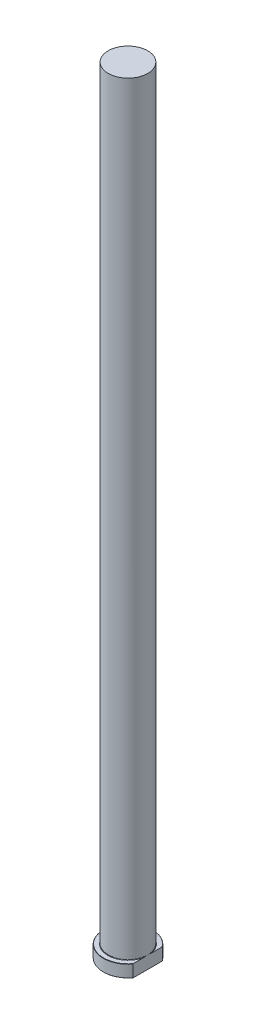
from build123d import *
from build123d.topology import SkipClean

# Parameters (mm, degrees)
CHAMFER1_SIZE = 0.2
FILLET1_R     = 0.3
KEY_DEPTH     = 631.634601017


with BuildPart() as part:
    # Sketch1 → Revolve1 (revolve)
    with BuildSketch(Plane.XY, mode=Mode.PRIVATE) as revolve1_sk:
        Polygon((0, 0), (-20, 0), (-20, 10), (-16, 10), (-16, 630), (0, 630), align=None)
    revolve(revolve1_sk.sketch.rotate(Axis((0, 259.958771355, 0), (0, -1, 0)), 270), axis=Axis((0, 259.958771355, 0), (0, -1, 0)))

    # Chamfer1
    chamfer1_edges = [part.edges().sort_by_distance(p)[0] for p in [
        (0, 10, -20),
        (0, 0, -20),
    ]]
    chamfer(chamfer1_edges, length=CHAMFER1_SIZE)

    # Fillet1
    fillet1_edges = [part.edges().sort_by_distance(p)[0] for p in [
        (0, 10, -16),
    ]]
    fillet(fillet1_edges, radius=FILLET1_R)

    # Sketch2 → KEY (cut, through all)
    with SkipClean():  # the faces are left unmerged after this step: merging them gives an invalid solid
        with BuildSketch(Plane(origin=(0, 0, 0), x_dir=(1, 0, 0), z_dir=(0, 1, 0))):
            with BuildLine():
                Line((16, 12), (16, -12))
                ThreePointArc((16, -12), (20, 0), (16, 12))
            make_face()
        extrude(amount=KEY_DEPTH, mode=Mode.SUBTRACT)


solid = part.part
